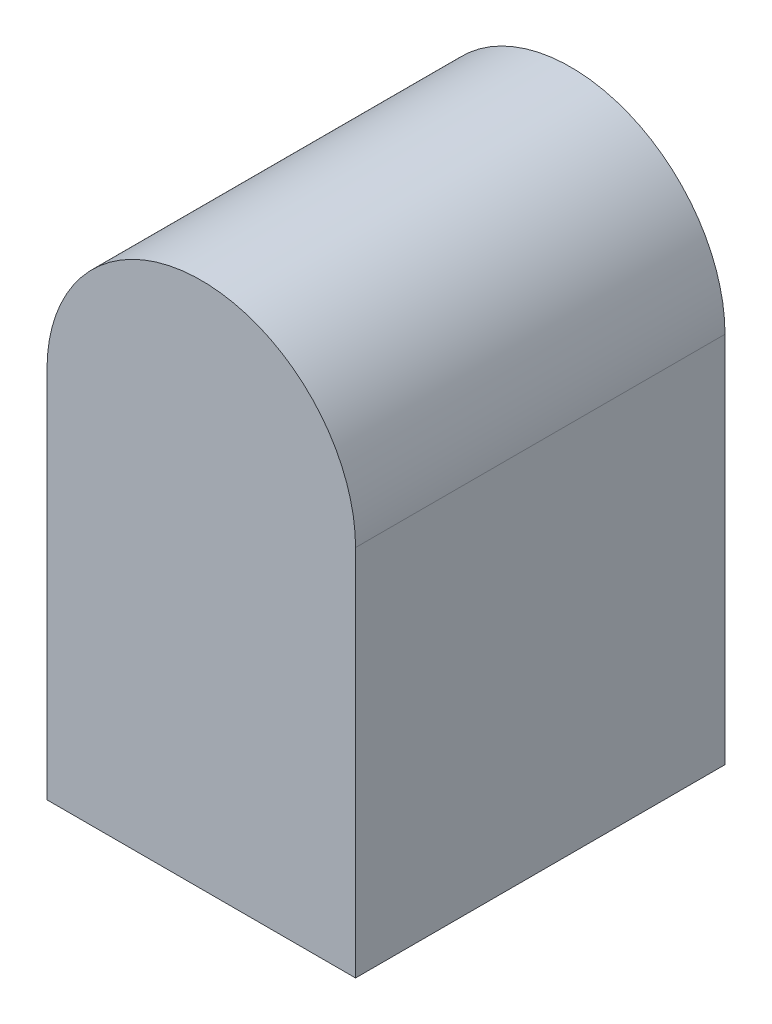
ISO-10303-21;
HEADER;
FILE_DESCRIPTION(('STEP AP214'),'2;1');
FILE_NAME('part.step','',(''),(''),'','','');
FILE_SCHEMA(('AUTOMOTIVE_DESIGN { 1 0 10303 214 1 1 1 1 }'));
ENDSEC;
DATA;
#1=APPLICATION_CONTEXT('core data for automotive mechanical design processes');
#2=APPLICATION_PROTOCOL_DEFINITION('international standard','automotive_design',2000,#1);
#3=PRODUCT_CONTEXT('',#1,'mechanical');
#4=PRODUCT('Part','Part','',(#3));
#5=PRODUCT_RELATED_PRODUCT_CATEGORY('part','',(#4));
#6=PRODUCT_DEFINITION_FORMATION('','',#4);
#7=PRODUCT_DEFINITION_CONTEXT('part definition',#1,'design');
#8=PRODUCT_DEFINITION('design','',#6,#7);
#9=PRODUCT_DEFINITION_SHAPE('','',#8);
#10=(LENGTH_UNIT() NAMED_UNIT(*) SI_UNIT(.MILLI.,.METRE.));
#11=(NAMED_UNIT(*) PLANE_ANGLE_UNIT() SI_UNIT($,.RADIAN.));
#12=(NAMED_UNIT(*) SI_UNIT($,.STERADIAN.) SOLID_ANGLE_UNIT());
#13=UNCERTAINTY_MEASURE_WITH_UNIT(LENGTH_MEASURE(1.E-05),#10,'distance_accuracy_value','');
#14=(GEOMETRIC_REPRESENTATION_CONTEXT(3) GLOBAL_UNCERTAINTY_ASSIGNED_CONTEXT((#13)) GLOBAL_UNIT_ASSIGNED_CONTEXT((#10,
#11,#12)) REPRESENTATION_CONTEXT('',''));
#15=CARTESIAN_POINT('',(0.,0.,0.));
#16=DIRECTION('',(0.,0.,1.));
#17=DIRECTION('',(1.,0.,0.));
#18=AXIS2_PLACEMENT_3D('',#15,#16,#17);
#19=CARTESIAN_POINT('',(0.,30.045438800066,50.8));
#20=DIRECTION('',(0.,0.,-1.));
#21=DIRECTION('',(-1.,0.,0.));
#22=AXIS2_PLACEMENT_3D('',#19,#20,#21);
#23=CYLINDRICAL_SURFACE('',#22,42.4258981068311);
#24=DIRECTION('',(0.,0.,-1.));
#25=VECTOR('',#24,1.);
#26=CARTESIAN_POINT('',(-42.4258981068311,30.045438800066,50.8));
#27=LINE('',#26,#25);
#28=CARTESIAN_POINT('',(-42.4258981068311,30.045438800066,50.8));
#29=VERTEX_POINT('',#28);
#30=CARTESIAN_POINT('',(-42.4258981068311,30.045438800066,-50.8));
#31=VERTEX_POINT('',#30);
#32=EDGE_CURVE('E91',#29,#31,#27,.T.);
#33=ORIENTED_EDGE('',*,*,#32,.F.);
#34=CARTESIAN_POINT('',(0.,30.045438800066,50.8));
#35=DIRECTION('',(0.,0.,-1.));
#36=DIRECTION('',(-1.,0.,0.));
#37=AXIS2_PLACEMENT_3D('',#34,#35,#36);
#38=CIRCLE('',#37,42.4258981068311);
#39=CARTESIAN_POINT('',(42.4258981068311,30.045438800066,50.8));
#40=VERTEX_POINT('',#39);
#41=EDGE_CURVE('E38',#40,#29,#38,.F.);
#42=ORIENTED_EDGE('',*,*,#41,.F.);
#43=DIRECTION('',(0.,0.,-1.));
#44=VECTOR('',#43,1.);
#45=CARTESIAN_POINT('',(42.4258981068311,30.045438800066,50.8));
#46=LINE('',#45,#44);
#47=CARTESIAN_POINT('',(42.4258981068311,30.045438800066,-50.8));
#48=VERTEX_POINT('',#47);
#49=EDGE_CURVE('E93',#48,#40,#46,.F.);
#50=ORIENTED_EDGE('',*,*,#49,.F.);
#51=CARTESIAN_POINT('',(0.,30.045438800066,-50.8));
#52=DIRECTION('',(0.,0.,-1.));
#53=DIRECTION('',(-1.,0.,0.));
#54=AXIS2_PLACEMENT_3D('',#51,#52,#53);
#55=CIRCLE('',#54,42.4258981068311);
#56=EDGE_CURVE('E11',#31,#48,#55,.T.);
#57=ORIENTED_EDGE('',*,*,#56,.F.);
#58=EDGE_LOOP('',(#33,#42,#50,#57));
#59=FACE_BOUND('',#58,.T.);
#60=ADVANCED_FACE('F31',(#59),#23,.T.);
#61=CARTESIAN_POINT('',(-42.4258981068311,-72.4713369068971,50.8));
#62=DIRECTION('',(1.,0.,0.));
#63=DIRECTION('',(0.,0.,-1.));
#64=AXIS2_PLACEMENT_3D('',#61,#62,#63);
#65=PLANE('',#64);
#66=DIRECTION('',(0.,-1.,0.));
#67=VECTOR('',#66,1.);
#68=CARTESIAN_POINT('',(-42.4258981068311,-72.4713369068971,50.8));
#69=LINE('',#68,#67);
#70=CARTESIAN_POINT('',(-42.4258981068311,-72.4713369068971,50.8));
#71=VERTEX_POINT('',#70);
#72=EDGE_CURVE('E68',#29,#71,#69,.T.);
#73=ORIENTED_EDGE('',*,*,#72,.F.);
#74=ORIENTED_EDGE('',*,*,#32,.T.);
#75=DIRECTION('',(0.,-1.,0.));
#76=VECTOR('',#75,1.);
#77=CARTESIAN_POINT('',(-42.4258981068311,-72.4713369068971,-50.8));
#78=LINE('',#77,#76);
#79=CARTESIAN_POINT('',(-42.4258981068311,-72.4713369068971,-50.8));
#80=VERTEX_POINT('',#79);
#81=EDGE_CURVE('E89',#31,#80,#78,.T.);
#82=ORIENTED_EDGE('',*,*,#81,.T.);
#83=DIRECTION('',(0.,0.,-1.));
#84=VECTOR('',#83,1.);
#85=CARTESIAN_POINT('',(-42.4258981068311,-72.4713369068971,50.8));
#86=LINE('',#85,#84);
#87=EDGE_CURVE('E82',#71,#80,#86,.T.);
#88=ORIENTED_EDGE('',*,*,#87,.F.);
#89=EDGE_LOOP('',(#73,#74,#82,#88));
#90=FACE_BOUND('',#89,.T.);
#91=ADVANCED_FACE('F88',(#90),#65,.F.);
#92=CARTESIAN_POINT('',(-42.4258981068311,-72.4713369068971,50.8));
#93=DIRECTION('',(0.,1.,0.));
#94=DIRECTION('',(0.,0.,1.));
#95=AXIS2_PLACEMENT_3D('',#92,#93,#94);
#96=PLANE('',#95);
#97=DIRECTION('',(1.,0.,0.));
#98=VECTOR('',#97,1.);
#99=CARTESIAN_POINT('',(-42.4258981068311,-72.4713369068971,-50.8));
#100=LINE('',#99,#98);
#101=CARTESIAN_POINT('',(42.4258981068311,-72.4713369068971,-50.8));
#102=VERTEX_POINT('',#101);
#103=EDGE_CURVE('E104',#80,#102,#100,.T.);
#104=ORIENTED_EDGE('',*,*,#103,.T.);
#105=DIRECTION('',(0.,0.,-1.));
#106=VECTOR('',#105,1.);
#107=CARTESIAN_POINT('',(42.4258981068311,-72.4713369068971,50.8));
#108=LINE('',#107,#106);
#109=CARTESIAN_POINT('',(42.4258981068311,-72.4713369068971,50.8));
#110=VERTEX_POINT('',#109);
#111=EDGE_CURVE('E84',#110,#102,#108,.T.);
#112=ORIENTED_EDGE('',*,*,#111,.F.);
#113=DIRECTION('',(1.,0.,0.));
#114=VECTOR('',#113,1.);
#115=CARTESIAN_POINT('',(-42.4258981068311,-72.4713369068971,50.8));
#116=LINE('',#115,#114);
#117=EDGE_CURVE('E72',#71,#110,#116,.T.);
#118=ORIENTED_EDGE('',*,*,#117,.F.);
#119=ORIENTED_EDGE('',*,*,#87,.T.);
#120=EDGE_LOOP('',(#104,#112,#118,#119));
#121=FACE_BOUND('',#120,.T.);
#122=ADVANCED_FACE('F81',(#121),#96,.F.);
#123=CARTESIAN_POINT('',(42.4258981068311,-72.4713369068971,50.8));
#124=DIRECTION('',(-1.,0.,0.));
#125=DIRECTION('',(0.,0.,1.));
#126=AXIS2_PLACEMENT_3D('',#123,#124,#125);
#127=PLANE('',#126);
#128=DIRECTION('',(0.,1.,0.));
#129=VECTOR('',#128,1.);
#130=CARTESIAN_POINT('',(42.4258981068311,-72.4713369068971,-50.8));
#131=LINE('',#130,#129);
#132=EDGE_CURVE('E77',#102,#48,#131,.T.);
#133=ORIENTED_EDGE('',*,*,#132,.T.);
#134=ORIENTED_EDGE('',*,*,#49,.T.);
#135=DIRECTION('',(0.,1.,0.));
#136=VECTOR('',#135,1.);
#137=CARTESIAN_POINT('',(42.4258981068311,-72.4713369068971,50.8));
#138=LINE('',#137,#136);
#139=EDGE_CURVE('E86',#110,#40,#138,.T.);
#140=ORIENTED_EDGE('',*,*,#139,.F.);
#141=ORIENTED_EDGE('',*,*,#111,.T.);
#142=EDGE_LOOP('',(#133,#134,#140,#141));
#143=FACE_BOUND('',#142,.T.);
#144=ADVANCED_FACE('F100',(#143),#127,.F.);
#145=CARTESIAN_POINT('',(-42.4258981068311,72.4713369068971,50.8));
#146=DIRECTION('',(0.,0.,-1.));
#147=DIRECTION('',(-1.,0.,0.));
#148=AXIS2_PLACEMENT_3D('',#145,#146,#147);
#149=PLANE('',#148);
#150=ORIENTED_EDGE('',*,*,#139,.T.);
#151=ORIENTED_EDGE('',*,*,#41,.T.);
#152=ORIENTED_EDGE('',*,*,#72,.T.);
#153=ORIENTED_EDGE('',*,*,#117,.T.);
#154=EDGE_LOOP('',(#150,#151,#152,#153));
#155=FACE_BOUND('',#154,.T.);
#156=ADVANCED_FACE('F71',(#155),#149,.F.);
#157=CARTESIAN_POINT('',(-42.4258981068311,72.4713369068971,-50.8));
#158=DIRECTION('',(0.,0.,-1.));
#159=DIRECTION('',(-1.,0.,0.));
#160=AXIS2_PLACEMENT_3D('',#157,#158,#159);
#161=PLANE('',#160);
#162=ORIENTED_EDGE('',*,*,#81,.F.);
#163=ORIENTED_EDGE('',*,*,#56,.T.);
#164=ORIENTED_EDGE('',*,*,#132,.F.);
#165=ORIENTED_EDGE('',*,*,#103,.F.);
#166=EDGE_LOOP('',(#162,#163,#164,#165));
#167=FACE_BOUND('',#166,.T.);
#168=ADVANCED_FACE('F105',(#167),#161,.T.);
#169=CLOSED_SHELL('',(#60,#91,#122,#144,#156,#168));
#170=MANIFOLD_SOLID_BREP('B2',#169);
#171=ADVANCED_BREP_SHAPE_REPRESENTATION('',(#18,#170),#14);
#172=SHAPE_DEFINITION_REPRESENTATION(#9,#171);
ENDSEC;
END-ISO-10303-21;
